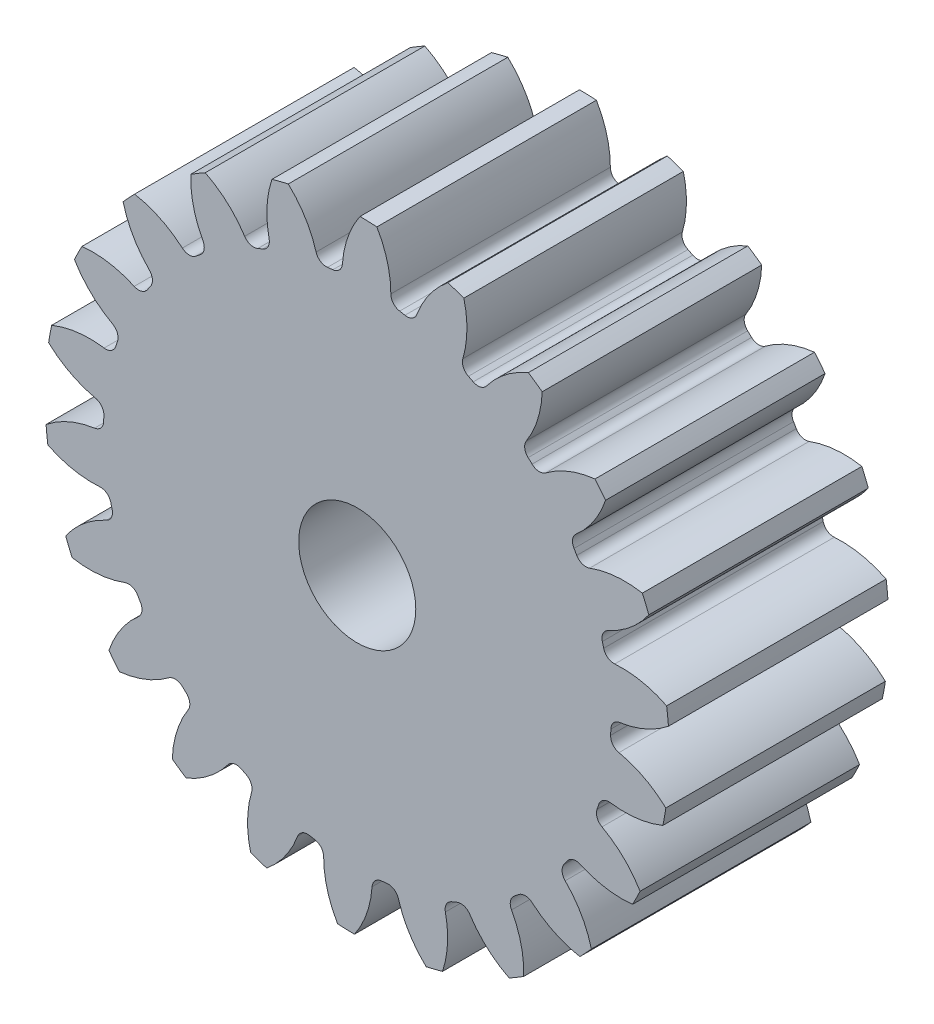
from build123d import *

# Parameters (mm, degrees)
SKETCH3_R         = 135.466666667
GEARBODY_DEPTH    = 95.25
TOOTHCUT_DEPTH    = 214.950924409
CIRPATTERN1_COUNT = 22
BOREDIA_R         = 25.4
BORE_DEPTH        = 12700


with BuildPart() as part:
    # Sketch3 → gearBody (new body)
    with BuildSketch(Plane.XY):
        Circle(SKETCH3_R)
    extrude(amount=GEARBODY_DEPTH)

    # Sketch2 → toothCut (cut, through all)
    with BuildSketch(Plane.XY):
        with BuildLine():
            ThreePointArc((109.947687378, -5.11636114), (109.995923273, -3.945627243), (110.031693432, -2.774446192))
            ThreePointArc((110.031693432, -2.774446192), (111.1912175, 0.162700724), (113.972591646, 1.657787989))
            ThreePointArc((113.972591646, 1.657787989), (125.374725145, 4.929209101), (135.466666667, 11.163273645))
            ThreePointArc((135.466666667, 11.163273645), (135.838485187, -4.872617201), (134.318664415, -20.840653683))
            ThreePointArc((134.318664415, -20.840653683), (124.699325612, -13.899532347), (113.560891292, -9.81956601))
            ThreePointArc((113.560891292, -9.81956601), (110.893787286, -8.129038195), (109.947687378, -5.11636114))
        make_face()
    toothcut = extrude(amount=TOOTHCUT_DEPTH, mode=Mode.SUBTRACT)

    # CirPattern1: toothCut ×22 about axis
    cirpattern1_axis = Axis((0, 0, 0), (0, 0, 1))
    for i in range(1, CIRPATTERN1_COUNT):
        add(toothcut.rotate(cirpattern1_axis, i * 360 / CIRPATTERN1_COUNT), mode=Mode.SUBTRACT)

    # boreDia → bore (cut, symmetric)
    with BuildSketch(Plane.XY):
        Circle(BOREDIA_R)
    extrude(amount=BORE_DEPTH, both=True, mode=Mode.SUBTRACT)


solid = part.part
